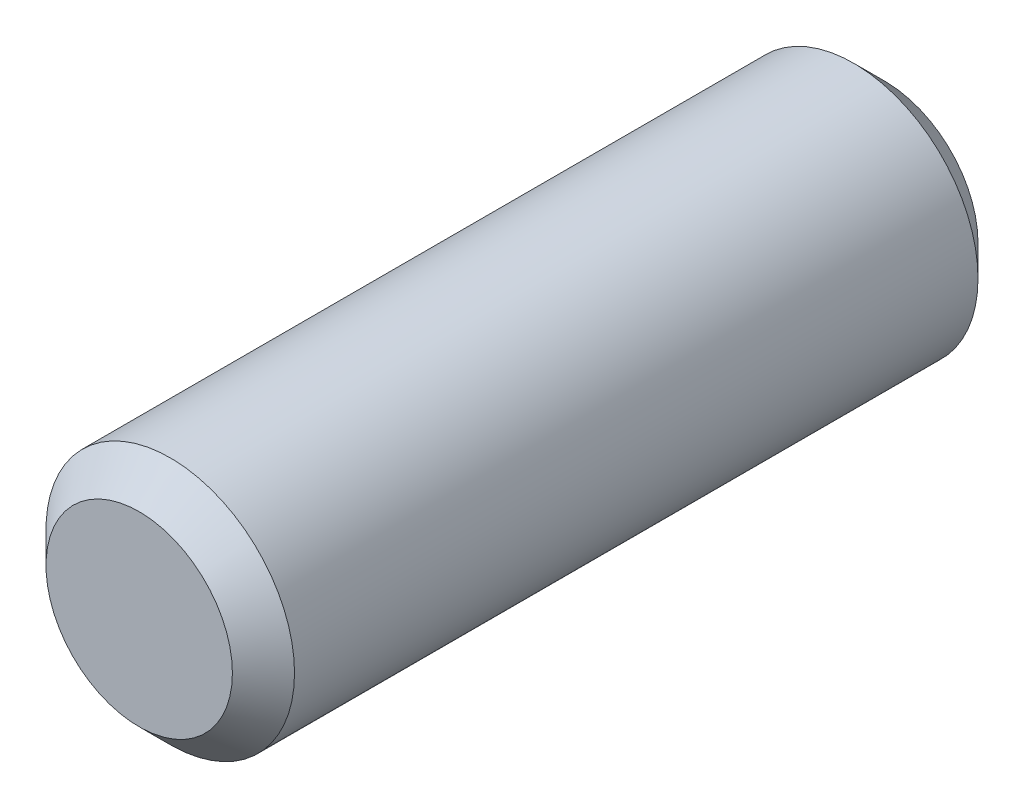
ISO-10303-21;
HEADER;
FILE_DESCRIPTION(('STEP AP214'),'2;1');
FILE_NAME('part.step','',(''),(''),'','','');
FILE_SCHEMA(('AUTOMOTIVE_DESIGN { 1 0 10303 214 1 1 1 1 }'));
ENDSEC;
DATA;
#1=APPLICATION_CONTEXT('core data for automotive mechanical design processes');
#2=APPLICATION_PROTOCOL_DEFINITION('international standard','automotive_design',2000,#1);
#3=PRODUCT_CONTEXT('',#1,'mechanical');
#4=PRODUCT('Part','Part','',(#3));
#5=PRODUCT_RELATED_PRODUCT_CATEGORY('part','',(#4));
#6=PRODUCT_DEFINITION_FORMATION('','',#4);
#7=PRODUCT_DEFINITION_CONTEXT('part definition',#1,'design');
#8=PRODUCT_DEFINITION('design','',#6,#7);
#9=PRODUCT_DEFINITION_SHAPE('','',#8);
#10=(LENGTH_UNIT() NAMED_UNIT(*) SI_UNIT(.MILLI.,.METRE.));
#11=(NAMED_UNIT(*) PLANE_ANGLE_UNIT() SI_UNIT($,.RADIAN.));
#12=(NAMED_UNIT(*) SI_UNIT($,.STERADIAN.) SOLID_ANGLE_UNIT());
#13=UNCERTAINTY_MEASURE_WITH_UNIT(LENGTH_MEASURE(1.E-05),#10,'distance_accuracy_value','');
#14=(GEOMETRIC_REPRESENTATION_CONTEXT(3) GLOBAL_UNCERTAINTY_ASSIGNED_CONTEXT((#13)) GLOBAL_UNIT_ASSIGNED_CONTEXT((#10,
#11,#12)) REPRESENTATION_CONTEXT('',''));
#15=CARTESIAN_POINT('',(0.,0.,0.));
#16=DIRECTION('',(0.,0.,1.));
#17=DIRECTION('',(1.,0.,0.));
#18=AXIS2_PLACEMENT_3D('',#15,#16,#17);
#19=CARTESIAN_POINT('',(0.,0.,-10.6746912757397));
#20=DIRECTION('',(0.,0.,1.));
#21=DIRECTION('',(1.,0.,0.));
#22=AXIS2_PLACEMENT_3D('',#19,#20,#21);
#23=CYLINDRICAL_SURFACE('',#22,0.999999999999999);
#24=CARTESIAN_POINT('',(0.,0.,-0.250013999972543));
#25=DIRECTION('',(0.,0.,1.));
#26=DIRECTION('',(1.,0.,0.));
#27=AXIS2_PLACEMENT_3D('',#24,#25,#26);
#28=CIRCLE('',#27,0.999999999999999);
#29=CARTESIAN_POINT('',(0.999999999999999,0.,-0.250013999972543));
#30=VERTEX_POINT('',#29);
#31=EDGE_CURVE('E10',#30,#30,#28,.T.);
#32=ORIENTED_EDGE('',*,*,#31,.F.);
#33=EDGE_LOOP('',(#32));
#34=FACE_BOUND('',#33,.T.);
#35=CARTESIAN_POINT('',(0.,0.,-5.74998600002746));
#36=DIRECTION('',(0.,0.,1.));
#37=DIRECTION('',(1.,0.,0.));
#38=AXIS2_PLACEMENT_3D('',#35,#36,#37);
#39=CIRCLE('',#38,0.999999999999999);
#40=CARTESIAN_POINT('',(0.999999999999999,0.,-5.74998600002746));
#41=VERTEX_POINT('',#40);
#42=EDGE_CURVE('E44',#41,#41,#39,.T.);
#43=ORIENTED_EDGE('',*,*,#42,.T.);
#44=EDGE_LOOP('',(#43));
#45=FACE_BOUND('',#44,.T.);
#46=ADVANCED_FACE('F30',(#34,#45),#23,.T.);
#47=CARTESIAN_POINT('',(0.,0.,-0.250013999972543));
#48=DIRECTION('',(0.,0.,-1.));
#49=DIRECTION('',(-1.,0.,0.));
#50=AXIS2_PLACEMENT_3D('',#47,#48,#49);
#51=CONICAL_SURFACE('',#50,0.999999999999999,0.785398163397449);
#52=CARTESIAN_POINT('',(0.,0.,0.));
#53=DIRECTION('',(0.,0.,1.));
#54=DIRECTION('',(1.,0.,0.));
#55=AXIS2_PLACEMENT_3D('',#52,#53,#54);
#56=CIRCLE('',#55,0.749986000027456);
#57=CARTESIAN_POINT('',(0.749986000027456,0.,0.));
#58=VERTEX_POINT('',#57);
#59=EDGE_CURVE('E36',#58,#58,#56,.T.);
#60=ORIENTED_EDGE('',*,*,#59,.F.);
#61=EDGE_LOOP('',(#60));
#62=FACE_BOUND('',#61,.T.);
#63=ORIENTED_EDGE('',*,*,#31,.T.);
#64=EDGE_LOOP('',(#63));
#65=FACE_BOUND('',#64,.T.);
#66=ADVANCED_FACE('F64',(#62,#65),#51,.T.);
#67=CARTESIAN_POINT('',(0.,0.749986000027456,0.));
#68=DIRECTION('',(0.,0.,-1.));
#69=DIRECTION('',(-1.,0.,0.));
#70=AXIS2_PLACEMENT_3D('',#67,#68,#69);
#71=PLANE('',#70);
#72=ORIENTED_EDGE('',*,*,#59,.T.);
#73=EDGE_LOOP('',(#72));
#74=FACE_BOUND('',#73,.T.);
#75=ADVANCED_FACE('F59',(#74),#71,.F.);
#76=CARTESIAN_POINT('',(0.,0.,-6.));
#77=DIRECTION('',(0.,0.,1.));
#78=DIRECTION('',(1.,0.,0.));
#79=AXIS2_PLACEMENT_3D('',#76,#77,#78);
#80=PLANE('',#79);
#81=CARTESIAN_POINT('',(0.,0.,-6.));
#82=DIRECTION('',(0.,0.,1.));
#83=DIRECTION('',(1.,0.,0.));
#84=AXIS2_PLACEMENT_3D('',#81,#82,#83);
#85=CIRCLE('',#84,0.749986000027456);
#86=CARTESIAN_POINT('',(0.749986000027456,0.,-6.));
#87=VERTEX_POINT('',#86);
#88=EDGE_CURVE('E40',#87,#87,#85,.T.);
#89=ORIENTED_EDGE('',*,*,#88,.F.);
#90=EDGE_LOOP('',(#89));
#91=FACE_BOUND('',#90,.T.);
#92=ADVANCED_FACE('F54',(#91),#80,.F.);
#93=CARTESIAN_POINT('',(0.,0.,-6.));
#94=DIRECTION('',(0.,0.,1.));
#95=DIRECTION('',(1.,0.,0.));
#96=AXIS2_PLACEMENT_3D('',#93,#94,#95);
#97=CONICAL_SURFACE('',#96,0.749986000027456,0.78539816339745);
#98=ORIENTED_EDGE('',*,*,#42,.F.);
#99=EDGE_LOOP('',(#98));
#100=FACE_BOUND('',#99,.T.);
#101=ORIENTED_EDGE('',*,*,#88,.T.);
#102=EDGE_LOOP('',(#101));
#103=FACE_BOUND('',#102,.T.);
#104=ADVANCED_FACE('F51',(#100,#103),#97,.T.);
#105=CLOSED_SHELL('',(#46,#66,#75,#92,#104));
#106=MANIFOLD_SOLID_BREP('B2',#105);
#107=ADVANCED_BREP_SHAPE_REPRESENTATION('',(#18,#106),#14);
#108=SHAPE_DEFINITION_REPRESENTATION(#9,#107);
ENDSEC;
END-ISO-10303-21;
